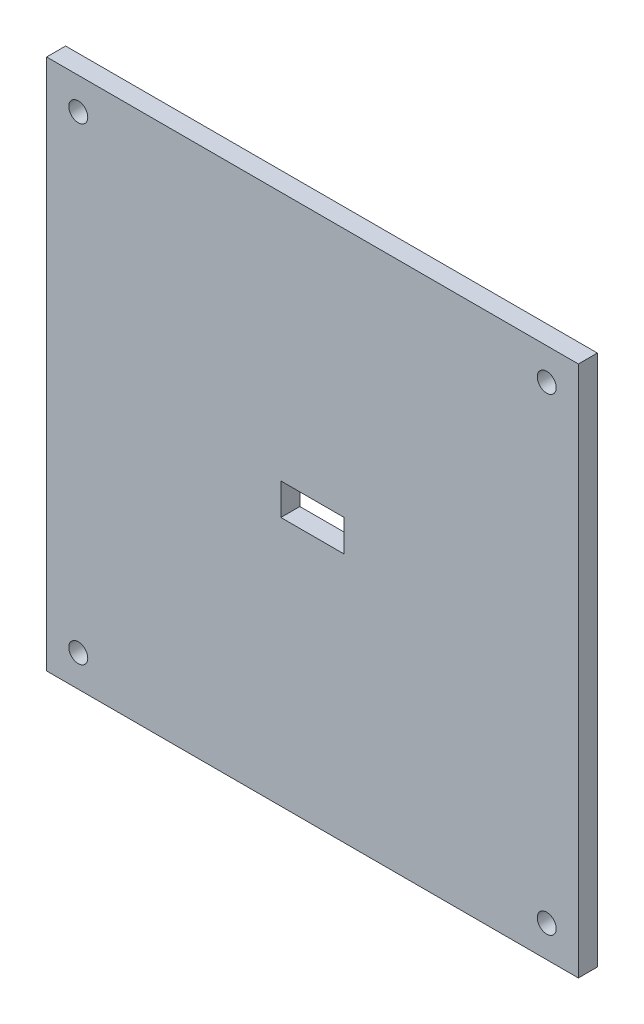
from build123d import *

# Parameters (mm, degrees)
SKETCH1_W           = 84
SKETCH1_H           = 84
SKETCH1_R           = 1.5
SKETCH1_W_2         = 10
SKETCH1_H_2         = 5
BOSS_EXTRUDE1_DEPTH = 3


with BuildPart() as part:
    # Sketch1 → Boss-Extrude1 (new body)
    with BuildSketch(Plane.XY):
        Rectangle(SKETCH1_W, SKETCH1_H)
        with Locations((-37, 37)):
            Circle(SKETCH1_R, mode=Mode.SUBTRACT)
        with Locations((37, 37)):
            Circle(SKETCH1_R, mode=Mode.SUBTRACT)
        with Locations((37, -37)):
            Circle(SKETCH1_R, mode=Mode.SUBTRACT)
        with Locations((-37, -37)):
            Circle(SKETCH1_R, mode=Mode.SUBTRACT)
        Rectangle(SKETCH1_W_2, SKETCH1_H_2, mode=Mode.SUBTRACT)
    extrude(amount=BOSS_EXTRUDE1_DEPTH)


solid = part.part
